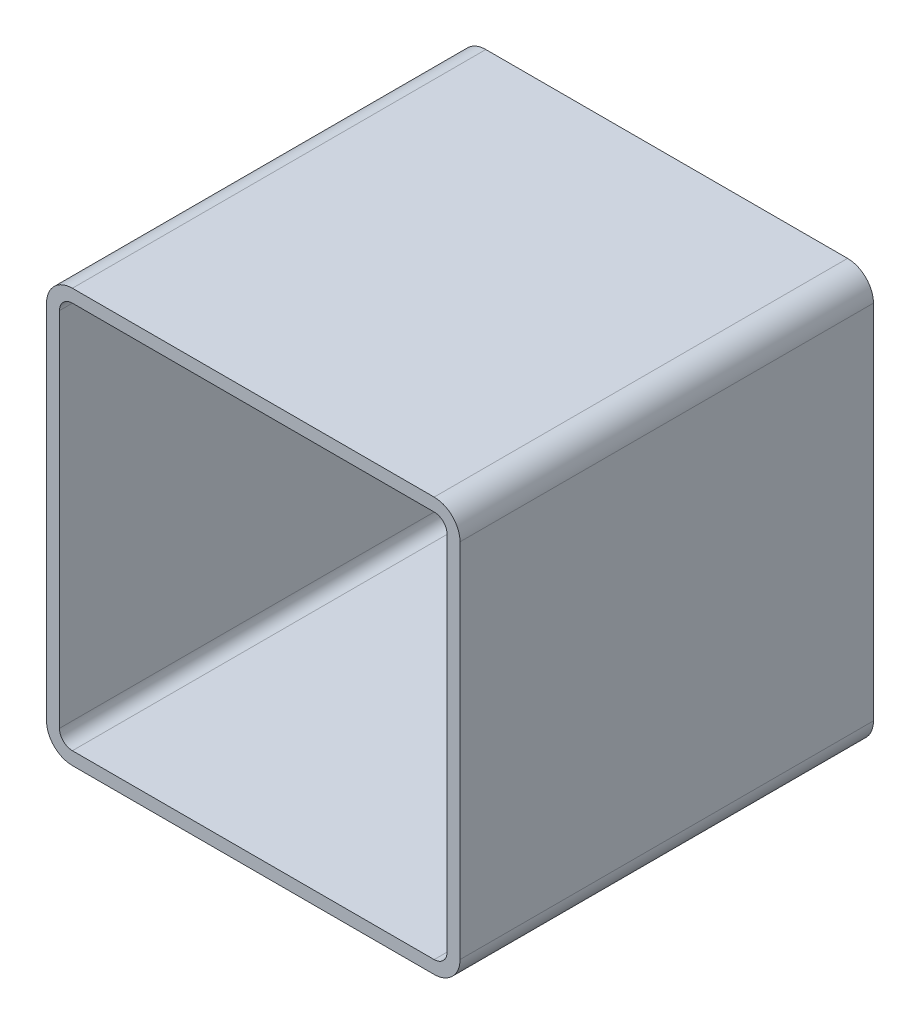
ISO-10303-21;
HEADER;
FILE_DESCRIPTION(('STEP AP214'),'2;1');
FILE_NAME('part.step','',(''),(''),'','','');
FILE_SCHEMA(('AUTOMOTIVE_DESIGN { 1 0 10303 214 1 1 1 1 }'));
ENDSEC;
DATA;
#1=APPLICATION_CONTEXT('core data for automotive mechanical design processes');
#2=APPLICATION_PROTOCOL_DEFINITION('international standard','automotive_design',2000,#1);
#3=PRODUCT_CONTEXT('',#1,'mechanical');
#4=PRODUCT('Part','Part','',(#3));
#5=PRODUCT_RELATED_PRODUCT_CATEGORY('part','',(#4));
#6=PRODUCT_DEFINITION_FORMATION('','',#4);
#7=PRODUCT_DEFINITION_CONTEXT('part definition',#1,'design');
#8=PRODUCT_DEFINITION('design','',#6,#7);
#9=PRODUCT_DEFINITION_SHAPE('','',#8);
#10=(LENGTH_UNIT() NAMED_UNIT(*) SI_UNIT(.MILLI.,.METRE.));
#11=(NAMED_UNIT(*) PLANE_ANGLE_UNIT() SI_UNIT($,.RADIAN.));
#12=(NAMED_UNIT(*) SI_UNIT($,.STERADIAN.) SOLID_ANGLE_UNIT());
#13=UNCERTAINTY_MEASURE_WITH_UNIT(LENGTH_MEASURE(1.E-05),#10,'distance_accuracy_value','');
#14=(GEOMETRIC_REPRESENTATION_CONTEXT(3) GLOBAL_UNCERTAINTY_ASSIGNED_CONTEXT((#13)) GLOBAL_UNIT_ASSIGNED_CONTEXT((#10,
#11,#12)) REPRESENTATION_CONTEXT('',''));
#15=CARTESIAN_POINT('',(0.,0.,0.));
#16=DIRECTION('',(0.,0.,1.));
#17=DIRECTION('',(1.,0.,0.));
#18=AXIS2_PLACEMENT_3D('',#15,#16,#17);
#19=CARTESIAN_POINT('',(20.1567030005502,287.624496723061,304.8));
#20=DIRECTION('',(0.,0.,1.));
#21=DIRECTION('',(1.,0.,0.));
#22=AXIS2_PLACEMENT_3D('',#19,#20,#21);
#23=PLANE('',#22);
#24=CARTESIAN_POINT('',(20.1567030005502,287.624496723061,304.8));
#25=DIRECTION('',(0.,0.,1.));
#26=DIRECTION('',(1.,0.,0.));
#27=AXIS2_PLACEMENT_3D('',#24,#25,#26);
#28=CIRCLE('',#27,19.05);
#29=CARTESIAN_POINT('',(20.1567030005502,306.674496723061,304.8));
#30=VERTEX_POINT('',#29);
#31=CARTESIAN_POINT('',(1.10670300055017,287.624496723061,304.8));
#32=VERTEX_POINT('',#31);
#33=EDGE_CURVE('E211',#30,#32,#28,.T.);
#34=ORIENTED_EDGE('',*,*,#33,.T.);
#35=DIRECTION('',(0.,-1.,0.));
#36=VECTOR('',#35,1.);
#37=CARTESIAN_POINT('',(1.10670300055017,20.9244967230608,304.8));
#38=LINE('',#37,#36);
#39=CARTESIAN_POINT('',(1.10670300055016,20.9244967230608,304.8));
#40=VERTEX_POINT('',#39);
#41=EDGE_CURVE('E214',#32,#40,#38,.T.);
#42=ORIENTED_EDGE('',*,*,#41,.T.);
#43=CARTESIAN_POINT('',(20.1567030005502,20.9244967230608,304.8));
#44=DIRECTION('',(0.,0.,1.));
#45=DIRECTION('',(1.,0.,0.));
#46=AXIS2_PLACEMENT_3D('',#43,#44,#45);
#47=CIRCLE('',#46,19.05);
#48=CARTESIAN_POINT('',(20.1567030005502,1.87449672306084,304.8));
#49=VERTEX_POINT('',#48);
#50=EDGE_CURVE('E217',#40,#49,#47,.T.);
#51=ORIENTED_EDGE('',*,*,#50,.T.);
#52=DIRECTION('',(1.,0.,0.));
#53=VECTOR('',#52,1.);
#54=CARTESIAN_POINT('',(286.85670300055,1.87449672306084,304.8));
#55=LINE('',#54,#53);
#56=CARTESIAN_POINT('',(286.85670300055,1.87449672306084,304.8));
#57=VERTEX_POINT('',#56);
#58=EDGE_CURVE('E219',#49,#57,#55,.T.);
#59=ORIENTED_EDGE('',*,*,#58,.T.);
#60=CARTESIAN_POINT('',(286.85670300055,20.9244967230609,304.8));
#61=DIRECTION('',(0.,0.,1.));
#62=DIRECTION('',(1.,0.,0.));
#63=AXIS2_PLACEMENT_3D('',#60,#61,#62);
#64=CIRCLE('',#63,19.05);
#65=CARTESIAN_POINT('',(305.90670300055,20.9244967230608,304.8));
#66=VERTEX_POINT('',#65);
#67=EDGE_CURVE('E221',#57,#66,#64,.T.);
#68=ORIENTED_EDGE('',*,*,#67,.T.);
#69=DIRECTION('',(0.,1.,0.));
#70=VECTOR('',#69,1.);
#71=CARTESIAN_POINT('',(305.90670300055,287.624496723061,304.8));
#72=LINE('',#71,#70);
#73=CARTESIAN_POINT('',(305.90670300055,287.624496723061,304.8));
#74=VERTEX_POINT('',#73);
#75=EDGE_CURVE('E223',#66,#74,#72,.T.);
#76=ORIENTED_EDGE('',*,*,#75,.T.);
#77=CARTESIAN_POINT('',(286.85670300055,287.624496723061,304.8));
#78=DIRECTION('',(0.,0.,1.));
#79=DIRECTION('',(1.,0.,0.));
#80=AXIS2_PLACEMENT_3D('',#77,#78,#79);
#81=CIRCLE('',#80,19.05);
#82=CARTESIAN_POINT('',(286.85670300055,306.674496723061,304.8));
#83=VERTEX_POINT('',#82);
#84=EDGE_CURVE('E225',#74,#83,#81,.T.);
#85=ORIENTED_EDGE('',*,*,#84,.T.);
#86=DIRECTION('',(-1.,0.,0.));
#87=VECTOR('',#86,1.);
#88=CARTESIAN_POINT('',(20.1567030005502,306.674496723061,304.8));
#89=LINE('',#88,#87);
#90=EDGE_CURVE('E227',#83,#30,#89,.T.);
#91=ORIENTED_EDGE('',*,*,#90,.T.);
#92=EDGE_LOOP('',(#34,#42,#51,#59,#68,#76,#85,#91));
#93=FACE_BOUND('',#92,.T.);
#94=DIRECTION('',(0.,-1.,0.));
#95=VECTOR('',#94,1.);
#96=CARTESIAN_POINT('',(10.6317030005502,20.9244967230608,304.8));
#97=LINE('',#96,#95);
#98=CARTESIAN_POINT('',(10.6317030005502,287.624496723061,304.8));
#99=VERTEX_POINT('',#98);
#100=CARTESIAN_POINT('',(10.6317030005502,20.9244967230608,304.8));
#101=VERTEX_POINT('',#100);
#102=EDGE_CURVE('E154',#99,#101,#97,.T.);
#103=ORIENTED_EDGE('',*,*,#102,.F.);
#104=CARTESIAN_POINT('',(20.1567030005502,287.624496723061,304.8));
#105=DIRECTION('',(0.,0.,1.));
#106=DIRECTION('',(1.,0.,0.));
#107=AXIS2_PLACEMENT_3D('',#104,#105,#106);
#108=CIRCLE('',#107,9.52500000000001);
#109=CARTESIAN_POINT('',(20.1567030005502,297.149496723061,304.8));
#110=VERTEX_POINT('',#109);
#111=EDGE_CURVE('E146',#110,#99,#108,.T.);
#112=ORIENTED_EDGE('',*,*,#111,.F.);
#113=DIRECTION('',(-1.,0.,0.));
#114=VECTOR('',#113,1.);
#115=CARTESIAN_POINT('',(20.1567030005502,297.149496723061,304.8));
#116=LINE('',#115,#114);
#117=CARTESIAN_POINT('',(286.85670300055,297.149496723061,304.8));
#118=VERTEX_POINT('',#117);
#119=EDGE_CURVE('E179',#118,#110,#116,.T.);
#120=ORIENTED_EDGE('',*,*,#119,.F.);
#121=CARTESIAN_POINT('',(286.85670300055,287.624496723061,304.8));
#122=DIRECTION('',(0.,0.,1.));
#123=DIRECTION('',(1.,0.,0.));
#124=AXIS2_PLACEMENT_3D('',#121,#122,#123);
#125=CIRCLE('',#124,9.52500000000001);
#126=CARTESIAN_POINT('',(296.38170300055,287.624496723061,304.8));
#127=VERTEX_POINT('',#126);
#128=EDGE_CURVE('E177',#127,#118,#125,.T.);
#129=ORIENTED_EDGE('',*,*,#128,.F.);
#130=DIRECTION('',(0.,1.,0.));
#131=VECTOR('',#130,1.);
#132=CARTESIAN_POINT('',(296.38170300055,287.624496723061,304.8));
#133=LINE('',#132,#131);
#134=CARTESIAN_POINT('',(296.38170300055,20.9244967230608,304.8));
#135=VERTEX_POINT('',#134);
#136=EDGE_CURVE('E175',#135,#127,#133,.T.);
#137=ORIENTED_EDGE('',*,*,#136,.F.);
#138=CARTESIAN_POINT('',(286.85670300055,20.9244967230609,304.8));
#139=DIRECTION('',(0.,0.,1.));
#140=DIRECTION('',(1.,0.,0.));
#141=AXIS2_PLACEMENT_3D('',#138,#139,#140);
#142=CIRCLE('',#141,9.52500000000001);
#143=CARTESIAN_POINT('',(286.85670300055,11.3994967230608,304.8));
#144=VERTEX_POINT('',#143);
#145=EDGE_CURVE('E173',#144,#135,#142,.T.);
#146=ORIENTED_EDGE('',*,*,#145,.F.);
#147=DIRECTION('',(1.,0.,0.));
#148=VECTOR('',#147,1.);
#149=CARTESIAN_POINT('',(286.85670300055,11.3994967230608,304.8));
#150=LINE('',#149,#148);
#151=CARTESIAN_POINT('',(20.1567030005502,11.3994967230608,304.8));
#152=VERTEX_POINT('',#151);
#153=EDGE_CURVE('E169',#152,#144,#150,.T.);
#154=ORIENTED_EDGE('',*,*,#153,.F.);
#155=CARTESIAN_POINT('',(20.1567030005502,20.9244967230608,304.8));
#156=DIRECTION('',(0.,0.,1.));
#157=DIRECTION('',(1.,0.,0.));
#158=AXIS2_PLACEMENT_3D('',#155,#156,#157);
#159=CIRCLE('',#158,9.525);
#160=EDGE_CURVE('E167',#101,#152,#159,.T.);
#161=ORIENTED_EDGE('',*,*,#160,.F.);
#162=EDGE_LOOP('',(#103,#112,#120,#129,#137,#146,#154,#161));
#163=FACE_BOUND('',#162,.T.);
#164=ADVANCED_FACE('F33',(#93,#163),#23,.T.);
#165=CARTESIAN_POINT('',(20.1567030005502,287.624496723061,0.));
#166=DIRECTION('',(0.,0.,1.));
#167=DIRECTION('',(1.,0.,0.));
#168=AXIS2_PLACEMENT_3D('',#165,#166,#167);
#169=PLANE('',#168);
#170=CARTESIAN_POINT('',(20.1567030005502,287.624496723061,0.));
#171=DIRECTION('',(0.,0.,1.));
#172=DIRECTION('',(1.,0.,0.));
#173=AXIS2_PLACEMENT_3D('',#170,#171,#172);
#174=CIRCLE('',#173,19.05);
#175=CARTESIAN_POINT('',(20.1567030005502,306.674496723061,0.));
#176=VERTEX_POINT('',#175);
#177=CARTESIAN_POINT('',(1.10670300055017,287.624496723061,0.));
#178=VERTEX_POINT('',#177);
#179=EDGE_CURVE('E162',#176,#178,#174,.T.);
#180=ORIENTED_EDGE('',*,*,#179,.F.);
#181=DIRECTION('',(-1.,0.,0.));
#182=VECTOR('',#181,1.);
#183=CARTESIAN_POINT('',(20.1567030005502,306.674496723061,0.));
#184=LINE('',#183,#182);
#185=CARTESIAN_POINT('',(286.85670300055,306.674496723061,0.));
#186=VERTEX_POINT('',#185);
#187=EDGE_CURVE('E215',#186,#176,#184,.T.);
#188=ORIENTED_EDGE('',*,*,#187,.F.);
#189=CARTESIAN_POINT('',(286.85670300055,287.624496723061,0.));
#190=DIRECTION('',(0.,0.,1.));
#191=DIRECTION('',(1.,0.,0.));
#192=AXIS2_PLACEMENT_3D('',#189,#190,#191);
#193=CIRCLE('',#192,19.05);
#194=CARTESIAN_POINT('',(305.90670300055,287.624496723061,0.));
#195=VERTEX_POINT('',#194);
#196=EDGE_CURVE('E242',#195,#186,#193,.T.);
#197=ORIENTED_EDGE('',*,*,#196,.F.);
#198=DIRECTION('',(0.,1.,0.));
#199=VECTOR('',#198,1.);
#200=CARTESIAN_POINT('',(305.90670300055,287.624496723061,0.));
#201=LINE('',#200,#199);
#202=CARTESIAN_POINT('',(305.90670300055,20.9244967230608,0.));
#203=VERTEX_POINT('',#202);
#204=EDGE_CURVE('E240',#203,#195,#201,.T.);
#205=ORIENTED_EDGE('',*,*,#204,.F.);
#206=CARTESIAN_POINT('',(286.85670300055,20.9244967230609,0.));
#207=DIRECTION('',(0.,0.,1.));
#208=DIRECTION('',(1.,0.,0.));
#209=AXIS2_PLACEMENT_3D('',#206,#207,#208);
#210=CIRCLE('',#209,19.05);
#211=CARTESIAN_POINT('',(286.85670300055,1.87449672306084,0.));
#212=VERTEX_POINT('',#211);
#213=EDGE_CURVE('E238',#212,#203,#210,.T.);
#214=ORIENTED_EDGE('',*,*,#213,.F.);
#215=DIRECTION('',(1.,0.,0.));
#216=VECTOR('',#215,1.);
#217=CARTESIAN_POINT('',(286.85670300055,1.87449672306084,0.));
#218=LINE('',#217,#216);
#219=CARTESIAN_POINT('',(20.1567030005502,1.87449672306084,0.));
#220=VERTEX_POINT('',#219);
#221=EDGE_CURVE('E236',#220,#212,#218,.T.);
#222=ORIENTED_EDGE('',*,*,#221,.F.);
#223=CARTESIAN_POINT('',(20.1567030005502,20.9244967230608,0.));
#224=DIRECTION('',(0.,0.,1.));
#225=DIRECTION('',(1.,0.,0.));
#226=AXIS2_PLACEMENT_3D('',#223,#224,#225);
#227=CIRCLE('',#226,19.05);
#228=CARTESIAN_POINT('',(1.10670300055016,20.9244967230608,0.));
#229=VERTEX_POINT('',#228);
#230=EDGE_CURVE('E234',#229,#220,#227,.T.);
#231=ORIENTED_EDGE('',*,*,#230,.F.);
#232=DIRECTION('',(0.,-1.,0.));
#233=VECTOR('',#232,1.);
#234=CARTESIAN_POINT('',(1.10670300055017,20.9244967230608,0.));
#235=LINE('',#234,#233);
#236=EDGE_CURVE('E232',#178,#229,#235,.T.);
#237=ORIENTED_EDGE('',*,*,#236,.F.);
#238=EDGE_LOOP('',(#180,#188,#197,#205,#214,#222,#231,#237));
#239=FACE_BOUND('',#238,.T.);
#240=CARTESIAN_POINT('',(20.1567030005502,287.624496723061,0.));
#241=DIRECTION('',(0.,0.,1.));
#242=DIRECTION('',(1.,0.,0.));
#243=AXIS2_PLACEMENT_3D('',#240,#241,#242);
#244=CIRCLE('',#243,9.52500000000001);
#245=CARTESIAN_POINT('',(20.1567030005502,297.149496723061,0.));
#246=VERTEX_POINT('',#245);
#247=CARTESIAN_POINT('',(10.6317030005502,287.624496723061,0.));
#248=VERTEX_POINT('',#247);
#249=EDGE_CURVE('E56',#246,#248,#244,.T.);
#250=ORIENTED_EDGE('',*,*,#249,.T.);
#251=DIRECTION('',(0.,-1.,0.));
#252=VECTOR('',#251,1.);
#253=CARTESIAN_POINT('',(10.6317030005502,20.9244967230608,0.));
#254=LINE('',#253,#252);
#255=CARTESIAN_POINT('',(10.6317030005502,20.9244967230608,0.));
#256=VERTEX_POINT('',#255);
#257=EDGE_CURVE('E161',#248,#256,#254,.T.);
#258=ORIENTED_EDGE('',*,*,#257,.T.);
#259=CARTESIAN_POINT('',(20.1567030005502,20.9244967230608,0.));
#260=DIRECTION('',(0.,0.,1.));
#261=DIRECTION('',(1.,0.,0.));
#262=AXIS2_PLACEMENT_3D('',#259,#260,#261);
#263=CIRCLE('',#262,9.525);
#264=CARTESIAN_POINT('',(20.1567030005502,11.3994967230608,0.));
#265=VERTEX_POINT('',#264);
#266=EDGE_CURVE('E183',#256,#265,#263,.T.);
#267=ORIENTED_EDGE('',*,*,#266,.T.);
#268=DIRECTION('',(1.,0.,0.));
#269=VECTOR('',#268,1.);
#270=CARTESIAN_POINT('',(286.85670300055,11.3994967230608,0.));
#271=LINE('',#270,#269);
#272=CARTESIAN_POINT('',(286.85670300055,11.3994967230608,0.));
#273=VERTEX_POINT('',#272);
#274=EDGE_CURVE('E186',#265,#273,#271,.T.);
#275=ORIENTED_EDGE('',*,*,#274,.T.);
#276=CARTESIAN_POINT('',(286.85670300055,20.9244967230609,0.));
#277=DIRECTION('',(0.,0.,1.));
#278=DIRECTION('',(1.,0.,0.));
#279=AXIS2_PLACEMENT_3D('',#276,#277,#278);
#280=CIRCLE('',#279,9.52500000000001);
#281=CARTESIAN_POINT('',(296.38170300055,20.9244967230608,0.));
#282=VERTEX_POINT('',#281);
#283=EDGE_CURVE('E189',#273,#282,#280,.T.);
#284=ORIENTED_EDGE('',*,*,#283,.T.);
#285=DIRECTION('',(0.,1.,0.));
#286=VECTOR('',#285,1.);
#287=CARTESIAN_POINT('',(296.38170300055,287.624496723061,0.));
#288=LINE('',#287,#286);
#289=CARTESIAN_POINT('',(296.38170300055,287.624496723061,0.));
#290=VERTEX_POINT('',#289);
#291=EDGE_CURVE('E192',#282,#290,#288,.T.);
#292=ORIENTED_EDGE('',*,*,#291,.T.);
#293=CARTESIAN_POINT('',(286.85670300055,287.624496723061,0.));
#294=DIRECTION('',(0.,0.,1.));
#295=DIRECTION('',(1.,0.,0.));
#296=AXIS2_PLACEMENT_3D('',#293,#294,#295);
#297=CIRCLE('',#296,9.52500000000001);
#298=CARTESIAN_POINT('',(286.85670300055,297.149496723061,0.));
#299=VERTEX_POINT('',#298);
#300=EDGE_CURVE('E195',#290,#299,#297,.T.);
#301=ORIENTED_EDGE('',*,*,#300,.T.);
#302=DIRECTION('',(-1.,0.,0.));
#303=VECTOR('',#302,1.);
#304=CARTESIAN_POINT('',(20.1567030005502,297.149496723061,0.));
#305=LINE('',#304,#303);
#306=EDGE_CURVE('E155',#299,#246,#305,.T.);
#307=ORIENTED_EDGE('',*,*,#306,.T.);
#308=EDGE_LOOP('',(#250,#258,#267,#275,#284,#292,#301,#307));
#309=FACE_BOUND('',#308,.T.);
#310=ADVANCED_FACE('F272',(#239,#309),#169,.F.);
#311=CARTESIAN_POINT('',(20.1567030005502,287.624496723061,304.8));
#312=DIRECTION('',(0.,0.,-1.));
#313=DIRECTION('',(-1.,0.,0.));
#314=AXIS2_PLACEMENT_3D('',#311,#312,#313);
#315=CYLINDRICAL_SURFACE('',#314,19.05);
#316=ORIENTED_EDGE('',*,*,#179,.T.);
#317=DIRECTION('',(0.,0.,-1.));
#318=VECTOR('',#317,1.);
#319=CARTESIAN_POINT('',(1.10670300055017,287.624496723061,304.8));
#320=LINE('',#319,#318);
#321=EDGE_CURVE('E11',#32,#178,#320,.T.);
#322=ORIENTED_EDGE('',*,*,#321,.F.);
#323=ORIENTED_EDGE('',*,*,#33,.F.);
#324=DIRECTION('',(0.,0.,-1.));
#325=VECTOR('',#324,1.);
#326=CARTESIAN_POINT('',(20.1567030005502,306.674496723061,304.8));
#327=LINE('',#326,#325);
#328=EDGE_CURVE('E229',#30,#176,#327,.T.);
#329=ORIENTED_EDGE('',*,*,#328,.T.);
#330=EDGE_LOOP('',(#316,#322,#323,#329));
#331=FACE_BOUND('',#330,.T.);
#332=ADVANCED_FACE('F35',(#331),#315,.T.);
#333=CARTESIAN_POINT('',(1.10670300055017,20.9244967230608,304.8));
#334=DIRECTION('',(1.,0.,0.));
#335=DIRECTION('',(0.,0.,-1.));
#336=AXIS2_PLACEMENT_3D('',#333,#334,#335);
#337=PLANE('',#336);
#338=ORIENTED_EDGE('',*,*,#236,.T.);
#339=DIRECTION('',(0.,0.,-1.));
#340=VECTOR('',#339,1.);
#341=CARTESIAN_POINT('',(1.10670300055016,20.9244967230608,304.8));
#342=LINE('',#341,#340);
#343=EDGE_CURVE('E41',#40,#229,#342,.T.);
#344=ORIENTED_EDGE('',*,*,#343,.F.);
#345=ORIENTED_EDGE('',*,*,#41,.F.);
#346=ORIENTED_EDGE('',*,*,#321,.T.);
#347=EDGE_LOOP('',(#338,#344,#345,#346));
#348=FACE_BOUND('',#347,.T.);
#349=ADVANCED_FACE('F289',(#348),#337,.F.);
#350=CARTESIAN_POINT('',(20.1567030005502,20.9244967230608,304.8));
#351=DIRECTION('',(0.,0.,-1.));
#352=DIRECTION('',(-1.,0.,0.));
#353=AXIS2_PLACEMENT_3D('',#350,#351,#352);
#354=CYLINDRICAL_SURFACE('',#353,19.05);
#355=ORIENTED_EDGE('',*,*,#230,.T.);
#356=DIRECTION('',(0.,0.,-1.));
#357=VECTOR('',#356,1.);
#358=CARTESIAN_POINT('',(20.1567030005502,1.87449672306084,304.8));
#359=LINE('',#358,#357);
#360=EDGE_CURVE('E259',#49,#220,#359,.T.);
#361=ORIENTED_EDGE('',*,*,#360,.F.);
#362=ORIENTED_EDGE('',*,*,#50,.F.);
#363=ORIENTED_EDGE('',*,*,#343,.T.);
#364=EDGE_LOOP('',(#355,#361,#362,#363));
#365=FACE_BOUND('',#364,.T.);
#366=ADVANCED_FACE('F266',(#365),#354,.T.);
#367=CARTESIAN_POINT('',(286.85670300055,1.87449672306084,304.8));
#368=DIRECTION('',(0.,1.,0.));
#369=DIRECTION('',(0.,0.,1.));
#370=AXIS2_PLACEMENT_3D('',#367,#368,#369);
#371=PLANE('',#370);
#372=ORIENTED_EDGE('',*,*,#221,.T.);
#373=DIRECTION('',(0.,0.,-1.));
#374=VECTOR('',#373,1.);
#375=CARTESIAN_POINT('',(286.85670300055,1.87449672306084,304.8));
#376=LINE('',#375,#374);
#377=EDGE_CURVE('E256',#57,#212,#376,.T.);
#378=ORIENTED_EDGE('',*,*,#377,.F.);
#379=ORIENTED_EDGE('',*,*,#58,.F.);
#380=ORIENTED_EDGE('',*,*,#360,.T.);
#381=EDGE_LOOP('',(#372,#378,#379,#380));
#382=FACE_BOUND('',#381,.T.);
#383=ADVANCED_FACE('F278',(#382),#371,.F.);
#384=CARTESIAN_POINT('',(286.85670300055,20.9244967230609,304.8));
#385=DIRECTION('',(0.,0.,-1.));
#386=DIRECTION('',(-1.,0.,0.));
#387=AXIS2_PLACEMENT_3D('',#384,#385,#386);
#388=CYLINDRICAL_SURFACE('',#387,19.05);
#389=ORIENTED_EDGE('',*,*,#213,.T.);
#390=DIRECTION('',(0.,0.,-1.));
#391=VECTOR('',#390,1.);
#392=CARTESIAN_POINT('',(305.90670300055,20.9244967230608,304.8));
#393=LINE('',#392,#391);
#394=EDGE_CURVE('E253',#66,#203,#393,.T.);
#395=ORIENTED_EDGE('',*,*,#394,.F.);
#396=ORIENTED_EDGE('',*,*,#67,.F.);
#397=ORIENTED_EDGE('',*,*,#377,.T.);
#398=EDGE_LOOP('',(#389,#395,#396,#397));
#399=FACE_BOUND('',#398,.T.);
#400=ADVANCED_FACE('F282',(#399),#388,.T.);
#401=CARTESIAN_POINT('',(305.90670300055,287.624496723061,304.8));
#402=DIRECTION('',(-1.,0.,0.));
#403=DIRECTION('',(0.,0.,1.));
#404=AXIS2_PLACEMENT_3D('',#401,#402,#403);
#405=PLANE('',#404);
#406=ORIENTED_EDGE('',*,*,#204,.T.);
#407=DIRECTION('',(0.,0.,-1.));
#408=VECTOR('',#407,1.);
#409=CARTESIAN_POINT('',(305.90670300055,287.624496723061,304.8));
#410=LINE('',#409,#408);
#411=EDGE_CURVE('E250',#74,#195,#410,.T.);
#412=ORIENTED_EDGE('',*,*,#411,.F.);
#413=ORIENTED_EDGE('',*,*,#75,.F.);
#414=ORIENTED_EDGE('',*,*,#394,.T.);
#415=EDGE_LOOP('',(#406,#412,#413,#414));
#416=FACE_BOUND('',#415,.T.);
#417=ADVANCED_FACE('F302',(#416),#405,.F.);
#418=CARTESIAN_POINT('',(286.85670300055,287.624496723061,304.8));
#419=DIRECTION('',(0.,0.,-1.));
#420=DIRECTION('',(-1.,0.,0.));
#421=AXIS2_PLACEMENT_3D('',#418,#419,#420);
#422=CYLINDRICAL_SURFACE('',#421,19.05);
#423=ORIENTED_EDGE('',*,*,#196,.T.);
#424=DIRECTION('',(0.,0.,-1.));
#425=VECTOR('',#424,1.);
#426=CARTESIAN_POINT('',(286.85670300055,306.674496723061,304.8));
#427=LINE('',#426,#425);
#428=EDGE_CURVE('E247',#83,#186,#427,.T.);
#429=ORIENTED_EDGE('',*,*,#428,.F.);
#430=ORIENTED_EDGE('',*,*,#84,.F.);
#431=ORIENTED_EDGE('',*,*,#411,.T.);
#432=EDGE_LOOP('',(#423,#429,#430,#431));
#433=FACE_BOUND('',#432,.T.);
#434=ADVANCED_FACE('F300',(#433),#422,.T.);
#435=CARTESIAN_POINT('',(20.1567030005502,306.674496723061,304.8));
#436=DIRECTION('',(0.,-1.,0.));
#437=DIRECTION('',(0.,0.,-1.));
#438=AXIS2_PLACEMENT_3D('',#435,#436,#437);
#439=PLANE('',#438);
#440=ORIENTED_EDGE('',*,*,#187,.T.);
#441=ORIENTED_EDGE('',*,*,#328,.F.);
#442=ORIENTED_EDGE('',*,*,#90,.F.);
#443=ORIENTED_EDGE('',*,*,#428,.T.);
#444=EDGE_LOOP('',(#440,#441,#442,#443));
#445=FACE_BOUND('',#444,.T.);
#446=ADVANCED_FACE('F295',(#445),#439,.F.);
#447=CARTESIAN_POINT('',(20.1567030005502,287.624496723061,304.8));
#448=DIRECTION('',(0.,0.,-1.));
#449=DIRECTION('',(-1.,0.,0.));
#450=AXIS2_PLACEMENT_3D('',#447,#448,#449);
#451=CYLINDRICAL_SURFACE('',#450,9.52500000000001);
#452=ORIENTED_EDGE('',*,*,#249,.F.);
#453=DIRECTION('',(0.,0.,-1.));
#454=VECTOR('',#453,1.);
#455=CARTESIAN_POINT('',(20.1567030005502,297.149496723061,304.8));
#456=LINE('',#455,#454);
#457=EDGE_CURVE('E150',#110,#246,#456,.T.);
#458=ORIENTED_EDGE('',*,*,#457,.F.);
#459=ORIENTED_EDGE('',*,*,#111,.T.);
#460=DIRECTION('',(0.,0.,-1.));
#461=VECTOR('',#460,1.);
#462=CARTESIAN_POINT('',(10.6317030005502,287.624496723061,304.8));
#463=LINE('',#462,#461);
#464=EDGE_CURVE('E149',#99,#248,#463,.T.);
#465=ORIENTED_EDGE('',*,*,#464,.T.);
#466=EDGE_LOOP('',(#452,#458,#459,#465));
#467=FACE_BOUND('',#466,.T.);
#468=ADVANCED_FACE('F148',(#467),#451,.F.);
#469=CARTESIAN_POINT('',(10.6317030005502,20.9244967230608,304.8));
#470=DIRECTION('',(1.,0.,0.));
#471=DIRECTION('',(0.,0.,-1.));
#472=AXIS2_PLACEMENT_3D('',#469,#470,#471);
#473=PLANE('',#472);
#474=ORIENTED_EDGE('',*,*,#257,.F.);
#475=ORIENTED_EDGE('',*,*,#464,.F.);
#476=ORIENTED_EDGE('',*,*,#102,.T.);
#477=DIRECTION('',(0.,0.,-1.));
#478=VECTOR('',#477,1.);
#479=CARTESIAN_POINT('',(10.6317030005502,20.9244967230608,304.8));
#480=LINE('',#479,#478);
#481=EDGE_CURVE('E163',#101,#256,#480,.T.);
#482=ORIENTED_EDGE('',*,*,#481,.T.);
#483=EDGE_LOOP('',(#474,#475,#476,#482));
#484=FACE_BOUND('',#483,.T.);
#485=ADVANCED_FACE('F158',(#484),#473,.T.);
#486=CARTESIAN_POINT('',(20.1567030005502,20.9244967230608,304.8));
#487=DIRECTION('',(0.,0.,-1.));
#488=DIRECTION('',(-1.,0.,0.));
#489=AXIS2_PLACEMENT_3D('',#486,#487,#488);
#490=CYLINDRICAL_SURFACE('',#489,9.525);
#491=ORIENTED_EDGE('',*,*,#266,.F.);
#492=ORIENTED_EDGE('',*,*,#481,.F.);
#493=ORIENTED_EDGE('',*,*,#160,.T.);
#494=DIRECTION('',(0.,0.,-1.));
#495=VECTOR('',#494,1.);
#496=CARTESIAN_POINT('',(20.1567030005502,11.3994967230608,304.8));
#497=LINE('',#496,#495);
#498=EDGE_CURVE('E208',#152,#265,#497,.T.);
#499=ORIENTED_EDGE('',*,*,#498,.T.);
#500=EDGE_LOOP('',(#491,#492,#493,#499));
#501=FACE_BOUND('',#500,.T.);
#502=ADVANCED_FACE('F327',(#501),#490,.F.);
#503=CARTESIAN_POINT('',(286.85670300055,11.3994967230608,304.8));
#504=DIRECTION('',(0.,1.,0.));
#505=DIRECTION('',(0.,0.,1.));
#506=AXIS2_PLACEMENT_3D('',#503,#504,#505);
#507=PLANE('',#506);
#508=ORIENTED_EDGE('',*,*,#274,.F.);
#509=ORIENTED_EDGE('',*,*,#498,.F.);
#510=ORIENTED_EDGE('',*,*,#153,.T.);
#511=DIRECTION('',(0.,0.,-1.));
#512=VECTOR('',#511,1.);
#513=CARTESIAN_POINT('',(286.85670300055,11.3994967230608,304.8));
#514=LINE('',#513,#512);
#515=EDGE_CURVE('E206',#144,#273,#514,.T.);
#516=ORIENTED_EDGE('',*,*,#515,.T.);
#517=EDGE_LOOP('',(#508,#509,#510,#516));
#518=FACE_BOUND('',#517,.T.);
#519=ADVANCED_FACE('F331',(#518),#507,.T.);
#520=CARTESIAN_POINT('',(286.85670300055,20.9244967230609,304.8));
#521=DIRECTION('',(0.,0.,-1.));
#522=DIRECTION('',(-1.,0.,0.));
#523=AXIS2_PLACEMENT_3D('',#520,#521,#522);
#524=CYLINDRICAL_SURFACE('',#523,9.52500000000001);
#525=ORIENTED_EDGE('',*,*,#283,.F.);
#526=ORIENTED_EDGE('',*,*,#515,.F.);
#527=ORIENTED_EDGE('',*,*,#145,.T.);
#528=DIRECTION('',(0.,0.,-1.));
#529=VECTOR('',#528,1.);
#530=CARTESIAN_POINT('',(296.38170300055,20.9244967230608,304.8));
#531=LINE('',#530,#529);
#532=EDGE_CURVE('E204',#135,#282,#531,.T.);
#533=ORIENTED_EDGE('',*,*,#532,.T.);
#534=EDGE_LOOP('',(#525,#526,#527,#533));
#535=FACE_BOUND('',#534,.T.);
#536=ADVANCED_FACE('F337',(#535),#524,.F.);
#537=CARTESIAN_POINT('',(296.38170300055,287.624496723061,304.8));
#538=DIRECTION('',(-1.,0.,0.));
#539=DIRECTION('',(0.,0.,1.));
#540=AXIS2_PLACEMENT_3D('',#537,#538,#539);
#541=PLANE('',#540);
#542=ORIENTED_EDGE('',*,*,#291,.F.);
#543=ORIENTED_EDGE('',*,*,#532,.F.);
#544=ORIENTED_EDGE('',*,*,#136,.T.);
#545=DIRECTION('',(0.,0.,-1.));
#546=VECTOR('',#545,1.);
#547=CARTESIAN_POINT('',(296.38170300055,287.624496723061,304.8));
#548=LINE('',#547,#546);
#549=EDGE_CURVE('E202',#127,#290,#548,.T.);
#550=ORIENTED_EDGE('',*,*,#549,.T.);
#551=EDGE_LOOP('',(#542,#543,#544,#550));
#552=FACE_BOUND('',#551,.T.);
#553=ADVANCED_FACE('F341',(#552),#541,.T.);
#554=CARTESIAN_POINT('',(286.85670300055,287.624496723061,304.8));
#555=DIRECTION('',(0.,0.,-1.));
#556=DIRECTION('',(-1.,0.,0.));
#557=AXIS2_PLACEMENT_3D('',#554,#555,#556);
#558=CYLINDRICAL_SURFACE('',#557,9.52500000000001);
#559=ORIENTED_EDGE('',*,*,#300,.F.);
#560=ORIENTED_EDGE('',*,*,#549,.F.);
#561=ORIENTED_EDGE('',*,*,#128,.T.);
#562=DIRECTION('',(0.,0.,-1.));
#563=VECTOR('',#562,1.);
#564=CARTESIAN_POINT('',(286.85670300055,297.149496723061,304.8));
#565=LINE('',#564,#563);
#566=EDGE_CURVE('E48',#118,#299,#565,.T.);
#567=ORIENTED_EDGE('',*,*,#566,.T.);
#568=EDGE_LOOP('',(#559,#560,#561,#567));
#569=FACE_BOUND('',#568,.T.);
#570=ADVANCED_FACE('F345',(#569),#558,.F.);
#571=CARTESIAN_POINT('',(20.1567030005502,297.149496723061,304.8));
#572=DIRECTION('',(0.,-1.,0.));
#573=DIRECTION('',(0.,0.,-1.));
#574=AXIS2_PLACEMENT_3D('',#571,#572,#573);
#575=PLANE('',#574);
#576=ORIENTED_EDGE('',*,*,#306,.F.);
#577=ORIENTED_EDGE('',*,*,#566,.F.);
#578=ORIENTED_EDGE('',*,*,#119,.T.);
#579=ORIENTED_EDGE('',*,*,#457,.T.);
#580=EDGE_LOOP('',(#576,#577,#578,#579));
#581=FACE_BOUND('',#580,.T.);
#582=ADVANCED_FACE('F349',(#581),#575,.T.);
#583=CLOSED_SHELL('',(#164,#310,#332,#349,#366,#383,#400,#417,#434,#446,#468,#485,#502,#519,
#536,#553,#570,#582));
#584=MANIFOLD_SOLID_BREP('B2',#583);
#585=ADVANCED_BREP_SHAPE_REPRESENTATION('',(#18,#584),#14);
#586=SHAPE_DEFINITION_REPRESENTATION(#9,#585);
ENDSEC;
END-ISO-10303-21;
